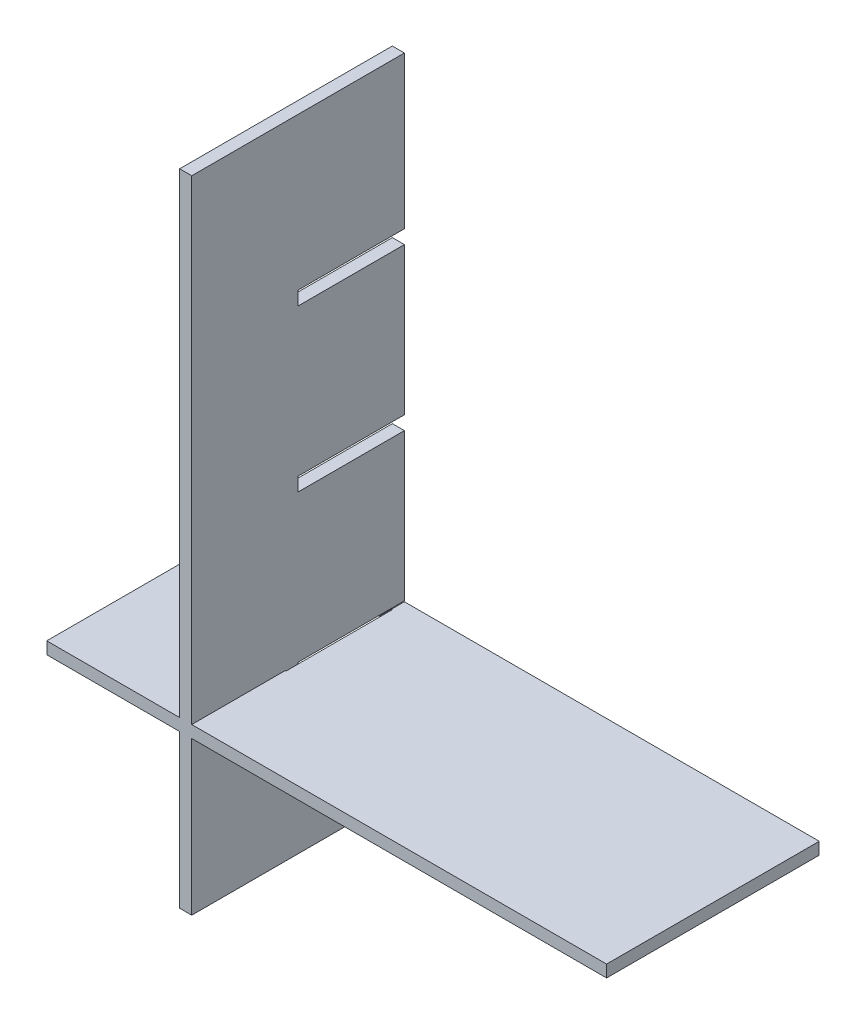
ISO-10303-21;
HEADER;
FILE_DESCRIPTION(('STEP AP214'),'2;1');
FILE_NAME('part.step','',(''),(''),'','','');
FILE_SCHEMA(('AUTOMOTIVE_DESIGN { 1 0 10303 214 1 1 1 1 }'));
ENDSEC;
DATA;
#1=APPLICATION_CONTEXT('core data for automotive mechanical design processes');
#2=APPLICATION_PROTOCOL_DEFINITION('international standard','automotive_design',2000,#1);
#3=PRODUCT_CONTEXT('',#1,'mechanical');
#4=PRODUCT('Part','Part','',(#3));
#5=PRODUCT_RELATED_PRODUCT_CATEGORY('part','',(#4));
#6=PRODUCT_DEFINITION_FORMATION('','',#4);
#7=PRODUCT_DEFINITION_CONTEXT('part definition',#1,'design');
#8=PRODUCT_DEFINITION('design','',#6,#7);
#9=PRODUCT_DEFINITION_SHAPE('','',#8);
#10=(LENGTH_UNIT() NAMED_UNIT(*) SI_UNIT(.MILLI.,.METRE.));
#11=(NAMED_UNIT(*) PLANE_ANGLE_UNIT() SI_UNIT($,.RADIAN.));
#12=(NAMED_UNIT(*) SI_UNIT($,.STERADIAN.) SOLID_ANGLE_UNIT());
#13=UNCERTAINTY_MEASURE_WITH_UNIT(LENGTH_MEASURE(1.E-05),#10,'distance_accuracy_value','');
#14=(GEOMETRIC_REPRESENTATION_CONTEXT(3) GLOBAL_UNCERTAINTY_ASSIGNED_CONTEXT((#13)) GLOBAL_UNIT_ASSIGNED_CONTEXT((#10,
#11,#12)) REPRESENTATION_CONTEXT('',''));
#15=CARTESIAN_POINT('',(0.,0.,0.));
#16=DIRECTION('',(0.,0.,1.));
#17=DIRECTION('',(1.,0.,0.));
#18=AXIS2_PLACEMENT_3D('',#15,#16,#17);
#19=CARTESIAN_POINT('',(0.,0.,0.));
#20=DIRECTION('',(0.,0.,-1.));
#21=DIRECTION('',(-1.,0.,0.));
#22=AXIS2_PLACEMENT_3D('',#19,#20,#21);
#23=PLANE('',#22);
#24=DIRECTION('',(1.,0.,0.));
#25=VECTOR('',#24,1.);
#26=CARTESIAN_POINT('',(-31.5590194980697,19.15,0.));
#27=LINE('',#26,#25);
#28=CARTESIAN_POINT('',(-18.25,19.15,0.));
#29=VERTEX_POINT('',#28);
#30=CARTESIAN_POINT('',(-16.75,19.15,0.));
#31=VERTEX_POINT('',#30);
#32=EDGE_CURVE('E270',#29,#31,#27,.T.);
#33=ORIENTED_EDGE('',*,*,#32,.T.);
#34=DIRECTION('',(0.,1.,0.));
#35=VECTOR('',#34,1.);
#36=CARTESIAN_POINT('',(-16.75,-39.75,0.));
#37=LINE('',#36,#35);
#38=CARTESIAN_POINT('',(-16.75,0.849999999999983,0.));
#39=VERTEX_POINT('',#38);
#40=EDGE_CURVE('E522',#39,#31,#37,.T.);
#41=ORIENTED_EDGE('',*,*,#40,.F.);
#42=DIRECTION('',(1.,0.,0.));
#43=VECTOR('',#42,1.);
#44=CARTESIAN_POINT('',(-31.5590194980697,0.849999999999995,0.));
#45=LINE('',#44,#43);
#46=CARTESIAN_POINT('',(-18.25,0.849999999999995,0.));
#47=VERTEX_POINT('',#46);
#48=EDGE_CURVE('E58',#47,#39,#45,.T.);
#49=ORIENTED_EDGE('',*,*,#48,.F.);
#50=DIRECTION('',(0.,-1.,0.));
#51=VECTOR('',#50,1.);
#52=CARTESIAN_POINT('',(-18.25,-39.75,0.));
#53=LINE('',#52,#51);
#54=EDGE_CURVE('E347',#29,#47,#53,.T.);
#55=ORIENTED_EDGE('',*,*,#54,.F.);
#56=EDGE_LOOP('',(#33,#41,#49,#55));
#57=FACE_BOUND('',#56,.T.);
#58=ADVANCED_FACE('F35',(#57),#23,.T.);
#59=DIRECTION('',(1.,0.,0.));
#60=VECTOR('',#59,1.);
#61=CARTESIAN_POINT('',(-31.5590194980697,-0.850000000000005,0.));
#62=LINE('',#61,#60);
#63=CARTESIAN_POINT('',(-18.25,-0.850000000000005,0.));
#64=VERTEX_POINT('',#63);
#65=CARTESIAN_POINT('',(-16.75,-0.850000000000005,0.));
#66=VERTEX_POINT('',#65);
#67=EDGE_CURVE('E282',#64,#66,#62,.T.);
#68=ORIENTED_EDGE('',*,*,#67,.T.);
#69=CARTESIAN_POINT('',(-16.75,-19.15,0.));
#70=VERTEX_POINT('',#69);
#71=EDGE_CURVE('E354',#70,#66,#37,.T.);
#72=ORIENTED_EDGE('',*,*,#71,.F.);
#73=DIRECTION('',(1.,0.,0.));
#74=VECTOR('',#73,1.);
#75=CARTESIAN_POINT('',(-31.5590194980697,-19.15,0.));
#76=LINE('',#75,#74);
#77=CARTESIAN_POINT('',(-18.25,-19.15,0.));
#78=VERTEX_POINT('',#77);
#79=EDGE_CURVE('E319',#78,#70,#76,.T.);
#80=ORIENTED_EDGE('',*,*,#79,.F.);
#81=EDGE_CURVE('E849',#64,#78,#53,.T.);
#82=ORIENTED_EDGE('',*,*,#81,.F.);
#83=EDGE_LOOP('',(#68,#72,#80,#82));
#84=FACE_BOUND('',#83,.T.);
#85=ADVANCED_FACE('F520',(#84),#23,.T.);
#86=DIRECTION('',(1.,0.,0.));
#87=VECTOR('',#86,1.);
#88=CARTESIAN_POINT('',(-31.5590194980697,-20.85,0.));
#89=LINE('',#88,#87);
#90=CARTESIAN_POINT('',(-18.25,-20.85,0.));
#91=VERTEX_POINT('',#90);
#92=CARTESIAN_POINT('',(-16.75,-20.85,0.));
#93=VERTEX_POINT('',#92);
#94=EDGE_CURVE('E303',#91,#93,#89,.T.);
#95=ORIENTED_EDGE('',*,*,#94,.T.);
#96=CARTESIAN_POINT('',(-16.75,-39.75,0.));
#97=VERTEX_POINT('',#96);
#98=EDGE_CURVE('E350',#97,#93,#37,.T.);
#99=ORIENTED_EDGE('',*,*,#98,.F.);
#100=DIRECTION('',(1.,0.,0.));
#101=VECTOR('',#100,1.);
#102=CARTESIAN_POINT('',(-18.25,-39.75,0.));
#103=LINE('',#102,#101);
#104=CARTESIAN_POINT('',(-18.25,-39.75,0.));
#105=VERTEX_POINT('',#104);
#106=EDGE_CURVE('E346',#105,#97,#103,.T.);
#107=ORIENTED_EDGE('',*,*,#106,.F.);
#108=EDGE_CURVE('E329',#91,#105,#53,.T.);
#109=ORIENTED_EDGE('',*,*,#108,.F.);
#110=EDGE_LOOP('',(#95,#99,#107,#109));
#111=FACE_BOUND('',#110,.T.);
#112=ADVANCED_FACE('F497',(#111),#23,.T.);
#113=DIRECTION('',(1.,0.,0.));
#114=VECTOR('',#113,1.);
#115=CARTESIAN_POINT('',(-31.5590194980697,20.85,0.));
#116=LINE('',#115,#114);
#117=CARTESIAN_POINT('',(-18.25,20.85,0.));
#118=VERTEX_POINT('',#117);
#119=CARTESIAN_POINT('',(-16.75,20.85,0.));
#120=VERTEX_POINT('',#119);
#121=EDGE_CURVE('E50',#118,#120,#116,.T.);
#122=ORIENTED_EDGE('',*,*,#121,.F.);
#123=CARTESIAN_POINT('',(-18.25,39.75,0.));
#124=VERTEX_POINT('',#123);
#125=EDGE_CURVE('E343',#124,#118,#53,.T.);
#126=ORIENTED_EDGE('',*,*,#125,.F.);
#127=DIRECTION('',(-1.,0.,0.));
#128=VECTOR('',#127,1.);
#129=CARTESIAN_POINT('',(-18.25,39.75,0.));
#130=LINE('',#129,#128);
#131=CARTESIAN_POINT('',(-16.75,39.75,0.));
#132=VERTEX_POINT('',#131);
#133=EDGE_CURVE('E353',#132,#124,#130,.T.);
#134=ORIENTED_EDGE('',*,*,#133,.F.);
#135=EDGE_CURVE('E349',#120,#132,#37,.T.);
#136=ORIENTED_EDGE('',*,*,#135,.F.);
#137=EDGE_LOOP('',(#122,#126,#134,#136));
#138=FACE_BOUND('',#137,.T.);
#139=ADVANCED_FACE('F532',(#138),#23,.T.);
#140=DIRECTION('',(-1.,0.,0.));
#141=VECTOR('',#140,1.);
#142=CARTESIAN_POINT('',(-34.75,-19.25,0.));
#143=LINE('',#142,#141);
#144=CARTESIAN_POINT('',(-18.25,-19.25,0.));
#145=VERTEX_POINT('',#144);
#146=CARTESIAN_POINT('',(-34.75,-19.25,0.));
#147=VERTEX_POINT('',#146);
#148=EDGE_CURVE('E423',#145,#147,#143,.T.);
#149=ORIENTED_EDGE('',*,*,#148,.F.);
#150=DIRECTION('',(0.,-1.,0.));
#151=VECTOR('',#150,1.);
#152=CARTESIAN_POINT('',(-18.25,-20.85,0.));
#153=LINE('',#152,#151);
#154=CARTESIAN_POINT('',(-18.25,-20.75,0.));
#155=VERTEX_POINT('',#154);
#156=EDGE_CURVE('E305',#145,#155,#153,.T.);
#157=ORIENTED_EDGE('',*,*,#156,.T.);
#158=DIRECTION('',(1.,0.,0.));
#159=VECTOR('',#158,1.);
#160=CARTESIAN_POINT('',(-34.75,-20.75,0.));
#161=LINE('',#160,#159);
#162=CARTESIAN_POINT('',(-34.75,-20.75,0.));
#163=VERTEX_POINT('',#162);
#164=EDGE_CURVE('E443',#163,#155,#161,.T.);
#165=ORIENTED_EDGE('',*,*,#164,.F.);
#166=DIRECTION('',(0.,-1.,0.));
#167=VECTOR('',#166,1.);
#168=CARTESIAN_POINT('',(-34.75,-19.25,0.));
#169=LINE('',#168,#167);
#170=EDGE_CURVE('E440',#147,#163,#169,.T.);
#171=ORIENTED_EDGE('',*,*,#170,.F.);
#172=EDGE_LOOP('',(#149,#157,#165,#171));
#173=FACE_BOUND('',#172,.T.);
#174=ADVANCED_FACE('F565',(#173),#23,.T.);
#175=CARTESIAN_POINT('',(-34.75,-19.25,26.4));
#176=DIRECTION('',(0.,-1.,0.));
#177=DIRECTION('',(0.,0.,-1.));
#178=AXIS2_PLACEMENT_3D('',#175,#176,#177);
#179=PLANE('',#178);
#180=DIRECTION('',(0.,0.,1.));
#181=VECTOR('',#180,1.);
#182=CARTESIAN_POINT('',(-18.25,-19.25,26.4));
#183=LINE('',#182,#181);
#184=CARTESIAN_POINT('',(-18.25,-19.25,1.6));
#185=VERTEX_POINT('',#184);
#186=EDGE_CURVE('E385',#145,#185,#183,.T.);
#187=ORIENTED_EDGE('',*,*,#186,.F.);
#188=ORIENTED_EDGE('',*,*,#148,.T.);
#189=DIRECTION('',(0.,0.,-1.));
#190=VECTOR('',#189,1.);
#191=CARTESIAN_POINT('',(-34.75,-19.25,26.4));
#192=LINE('',#191,#190);
#193=CARTESIAN_POINT('',(-34.75,-19.25,26.4));
#194=VERTEX_POINT('',#193);
#195=EDGE_CURVE('E456',#194,#147,#192,.T.);
#196=ORIENTED_EDGE('',*,*,#195,.F.);
#197=DIRECTION('',(-1.,0.,0.));
#198=VECTOR('',#197,1.);
#199=CARTESIAN_POINT('',(-34.75,-19.25,26.4));
#200=LINE('',#199,#198);
#201=CARTESIAN_POINT('',(-18.25,-19.25,26.4));
#202=VERTEX_POINT('',#201);
#203=EDGE_CURVE('E428',#202,#194,#200,.T.);
#204=ORIENTED_EDGE('',*,*,#203,.F.);
#205=CARTESIAN_POINT('',(-18.25,-19.25,14.8));
#206=VERTEX_POINT('',#205);
#207=EDGE_CURVE('E380',#206,#202,#183,.T.);
#208=ORIENTED_EDGE('',*,*,#207,.F.);
#209=DIRECTION('',(1.,0.,0.));
#210=VECTOR('',#209,1.);
#211=CARTESIAN_POINT('',(-18.35,-19.25,14.8));
#212=LINE('',#211,#210);
#213=CARTESIAN_POINT('',(-18.35,-19.25,14.8));
#214=VERTEX_POINT('',#213);
#215=EDGE_CURVE('E420',#214,#206,#212,.T.);
#216=ORIENTED_EDGE('',*,*,#215,.F.);
#217=DIRECTION('',(0.,0.,1.));
#218=VECTOR('',#217,1.);
#219=CARTESIAN_POINT('',(-18.35,-19.25,1.6));
#220=LINE('',#219,#218);
#221=CARTESIAN_POINT('',(-18.35,-19.25,1.6));
#222=VERTEX_POINT('',#221);
#223=EDGE_CURVE('E387',#222,#214,#220,.T.);
#224=ORIENTED_EDGE('',*,*,#223,.F.);
#225=DIRECTION('',(-1.,0.,0.));
#226=VECTOR('',#225,1.);
#227=CARTESIAN_POINT('',(-18.35,-19.25,1.6));
#228=LINE('',#227,#226);
#229=EDGE_CURVE('E390',#185,#222,#228,.T.);
#230=ORIENTED_EDGE('',*,*,#229,.F.);
#231=EDGE_LOOP('',(#187,#188,#196,#204,#208,#216,#224,#230));
#232=FACE_BOUND('',#231,.T.);
#233=ADVANCED_FACE('F37',(#232),#179,.F.);
#234=DIRECTION('',(0.,0.,-1.));
#235=VECTOR('',#234,1.);
#236=CARTESIAN_POINT('',(-16.75,-19.25,26.4));
#237=LINE('',#236,#235);
#238=CARTESIAN_POINT('',(-16.75,-19.25,26.4));
#239=VERTEX_POINT('',#238);
#240=CARTESIAN_POINT('',(-16.75,-19.25,14.8));
#241=VERTEX_POINT('',#240);
#242=EDGE_CURVE('E370',#239,#241,#237,.T.);
#243=ORIENTED_EDGE('',*,*,#242,.F.);
#244=CARTESIAN_POINT('',(34.75,-19.25,26.4));
#245=VERTEX_POINT('',#244);
#246=EDGE_CURVE('E424',#245,#239,#200,.T.);
#247=ORIENTED_EDGE('',*,*,#246,.F.);
#248=DIRECTION('',(0.,0.,-1.));
#249=VECTOR('',#248,1.);
#250=CARTESIAN_POINT('',(34.75,-19.25,26.4));
#251=LINE('',#250,#249);
#252=CARTESIAN_POINT('',(34.75,-19.25,0.));
#253=VERTEX_POINT('',#252);
#254=EDGE_CURVE('E436',#245,#253,#251,.T.);
#255=ORIENTED_EDGE('',*,*,#254,.T.);
#256=CARTESIAN_POINT('',(-16.75,-19.25,0.));
#257=VERTEX_POINT('',#256);
#258=EDGE_CURVE('E437',#253,#257,#143,.T.);
#259=ORIENTED_EDGE('',*,*,#258,.T.);
#260=CARTESIAN_POINT('',(-16.75,-19.25,1.6));
#261=VERTEX_POINT('',#260);
#262=EDGE_CURVE('E375',#261,#257,#237,.T.);
#263=ORIENTED_EDGE('',*,*,#262,.F.);
#264=CARTESIAN_POINT('',(-16.65,-19.25,1.6));
#265=VERTEX_POINT('',#264);
#266=EDGE_CURVE('E392',#265,#261,#228,.T.);
#267=ORIENTED_EDGE('',*,*,#266,.F.);
#268=DIRECTION('',(0.,0.,-1.));
#269=VECTOR('',#268,1.);
#270=CARTESIAN_POINT('',(-16.65,-19.25,1.6));
#271=LINE('',#270,#269);
#272=CARTESIAN_POINT('',(-16.65,-19.25,14.8));
#273=VERTEX_POINT('',#272);
#274=EDGE_CURVE('E395',#273,#265,#271,.T.);
#275=ORIENTED_EDGE('',*,*,#274,.F.);
#276=EDGE_CURVE('E397',#241,#273,#212,.T.);
#277=ORIENTED_EDGE('',*,*,#276,.F.);
#278=EDGE_LOOP('',(#243,#247,#255,#259,#263,#267,#275,#277));
#279=FACE_BOUND('',#278,.T.);
#280=ADVANCED_FACE('F469',(#279),#179,.F.);
#281=CARTESIAN_POINT('',(-34.75,-20.75,26.4));
#282=DIRECTION('',(0.,1.,0.));
#283=DIRECTION('',(0.,0.,1.));
#284=AXIS2_PLACEMENT_3D('',#281,#282,#283);
#285=PLANE('',#284);
#286=DIRECTION('',(0.,0.,-1.));
#287=VECTOR('',#286,1.);
#288=CARTESIAN_POINT('',(-18.25,-20.75,26.4));
#289=LINE('',#288,#287);
#290=CARTESIAN_POINT('',(-18.25,-20.75,26.4));
#291=VERTEX_POINT('',#290);
#292=CARTESIAN_POINT('',(-18.25,-20.75,14.8));
#293=VERTEX_POINT('',#292);
#294=EDGE_CURVE('E377',#291,#293,#289,.T.);
#295=ORIENTED_EDGE('',*,*,#294,.F.);
#296=DIRECTION('',(1.,0.,0.));
#297=VECTOR('',#296,1.);
#298=CARTESIAN_POINT('',(-34.75,-20.75,26.4));
#299=LINE('',#298,#297);
#300=CARTESIAN_POINT('',(-34.75,-20.75,26.4));
#301=VERTEX_POINT('',#300);
#302=EDGE_CURVE('E431',#301,#291,#299,.T.);
#303=ORIENTED_EDGE('',*,*,#302,.F.);
#304=DIRECTION('',(0.,0.,-1.));
#305=VECTOR('',#304,1.);
#306=CARTESIAN_POINT('',(-34.75,-20.75,26.4));
#307=LINE('',#306,#305);
#308=EDGE_CURVE('E453',#301,#163,#307,.T.);
#309=ORIENTED_EDGE('',*,*,#308,.T.);
#310=ORIENTED_EDGE('',*,*,#164,.T.);
#311=CARTESIAN_POINT('',(-18.25,-20.75,1.6));
#312=VERTEX_POINT('',#311);
#313=EDGE_CURVE('E381',#312,#155,#289,.T.);
#314=ORIENTED_EDGE('',*,*,#313,.F.);
#315=DIRECTION('',(1.,0.,0.));
#316=VECTOR('',#315,1.);
#317=CARTESIAN_POINT('',(-18.35,-20.75,1.6));
#318=LINE('',#317,#316);
#319=CARTESIAN_POINT('',(-18.35,-20.75,1.6));
#320=VERTEX_POINT('',#319);
#321=EDGE_CURVE('E407',#320,#312,#318,.T.);
#322=ORIENTED_EDGE('',*,*,#321,.F.);
#323=DIRECTION('',(0.,0.,-1.));
#324=VECTOR('',#323,1.);
#325=CARTESIAN_POINT('',(-18.35,-20.75,1.6));
#326=LINE('',#325,#324);
#327=CARTESIAN_POINT('',(-18.35,-20.75,14.8));
#328=VERTEX_POINT('',#327);
#329=EDGE_CURVE('E403',#328,#320,#326,.T.);
#330=ORIENTED_EDGE('',*,*,#329,.F.);
#331=DIRECTION('',(-1.,0.,0.));
#332=VECTOR('',#331,1.);
#333=CARTESIAN_POINT('',(-18.35,-20.75,14.8));
#334=LINE('',#333,#332);
#335=EDGE_CURVE('E400',#293,#328,#334,.T.);
#336=ORIENTED_EDGE('',*,*,#335,.F.);
#337=EDGE_LOOP('',(#295,#303,#309,#310,#314,#322,#330,#336));
#338=FACE_BOUND('',#337,.T.);
#339=ADVANCED_FACE('F591',(#338),#285,.F.);
#340=DIRECTION('',(0.,0.,1.));
#341=VECTOR('',#340,1.);
#342=CARTESIAN_POINT('',(-16.75,-20.75,26.4));
#343=LINE('',#342,#341);
#344=CARTESIAN_POINT('',(-16.75,-20.75,0.));
#345=VERTEX_POINT('',#344);
#346=CARTESIAN_POINT('',(-16.75,-20.75,1.6));
#347=VERTEX_POINT('',#346);
#348=EDGE_CURVE('E371',#345,#347,#343,.T.);
#349=ORIENTED_EDGE('',*,*,#348,.F.);
#350=CARTESIAN_POINT('',(34.75,-20.75,0.));
#351=VERTEX_POINT('',#350);
#352=EDGE_CURVE('E442',#345,#351,#161,.T.);
#353=ORIENTED_EDGE('',*,*,#352,.T.);
#354=DIRECTION('',(0.,0.,-1.));
#355=VECTOR('',#354,1.);
#356=CARTESIAN_POINT('',(34.75,-20.75,26.4));
#357=LINE('',#356,#355);
#358=CARTESIAN_POINT('',(34.75,-20.75,26.4));
#359=VERTEX_POINT('',#358);
#360=EDGE_CURVE('E450',#359,#351,#357,.T.);
#361=ORIENTED_EDGE('',*,*,#360,.F.);
#362=CARTESIAN_POINT('',(-16.75,-20.75,26.4));
#363=VERTEX_POINT('',#362);
#364=EDGE_CURVE('E430',#363,#359,#299,.T.);
#365=ORIENTED_EDGE('',*,*,#364,.F.);
#366=CARTESIAN_POINT('',(-16.75,-20.75,14.8));
#367=VERTEX_POINT('',#366);
#368=EDGE_CURVE('E367',#367,#363,#343,.T.);
#369=ORIENTED_EDGE('',*,*,#368,.F.);
#370=CARTESIAN_POINT('',(-16.65,-20.75,14.8));
#371=VERTEX_POINT('',#370);
#372=EDGE_CURVE('E401',#371,#367,#334,.T.);
#373=ORIENTED_EDGE('',*,*,#372,.F.);
#374=DIRECTION('',(0.,0.,1.));
#375=VECTOR('',#374,1.);
#376=CARTESIAN_POINT('',(-16.65,-20.75,1.6));
#377=LINE('',#376,#375);
#378=CARTESIAN_POINT('',(-16.65,-20.75,1.6));
#379=VERTEX_POINT('',#378);
#380=EDGE_CURVE('E398',#379,#371,#377,.T.);
#381=ORIENTED_EDGE('',*,*,#380,.F.);
#382=EDGE_CURVE('E406',#347,#379,#318,.T.);
#383=ORIENTED_EDGE('',*,*,#382,.F.);
#384=EDGE_LOOP('',(#349,#353,#361,#365,#369,#373,#381,#383));
#385=FACE_BOUND('',#384,.T.);
#386=ADVANCED_FACE('F483',(#385),#285,.F.);
#387=CARTESIAN_POINT('',(-18.35,-5.9409805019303,1.6));
#388=DIRECTION('',(0.,0.,-1.));
#389=DIRECTION('',(-1.,0.,0.));
#390=AXIS2_PLACEMENT_3D('',#387,#388,#389);
#391=PLANE('',#390);
#392=DIRECTION('',(0.,-1.,0.));
#393=VECTOR('',#392,1.);
#394=CARTESIAN_POINT('',(-18.25,-5.9409805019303,1.6));
#395=LINE('',#394,#393);
#396=EDGE_CURVE('E384',#185,#312,#395,.T.);
#397=ORIENTED_EDGE('',*,*,#396,.F.);
#398=ORIENTED_EDGE('',*,*,#229,.T.);
#399=DIRECTION('',(0.,-1.,0.));
#400=VECTOR('',#399,1.);
#401=CARTESIAN_POINT('',(-18.35,-5.9409805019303,1.6));
#402=LINE('',#401,#400);
#403=EDGE_CURVE('E413',#222,#320,#402,.T.);
#404=ORIENTED_EDGE('',*,*,#403,.T.);
#405=ORIENTED_EDGE('',*,*,#321,.T.);
#406=EDGE_LOOP('',(#397,#398,#404,#405));
#407=FACE_BOUND('',#406,.T.);
#408=ADVANCED_FACE('F594',(#407),#391,.F.);
#409=DIRECTION('',(0.,1.,0.));
#410=VECTOR('',#409,1.);
#411=CARTESIAN_POINT('',(-16.75,-5.9409805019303,1.6));
#412=LINE('',#411,#410);
#413=EDGE_CURVE('E374',#347,#261,#412,.T.);
#414=ORIENTED_EDGE('',*,*,#413,.F.);
#415=ORIENTED_EDGE('',*,*,#382,.T.);
#416=DIRECTION('',(0.,-1.,0.));
#417=VECTOR('',#416,1.);
#418=CARTESIAN_POINT('',(-16.65,-5.9409805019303,1.6));
#419=LINE('',#418,#417);
#420=EDGE_CURVE('E391',#265,#379,#419,.T.);
#421=ORIENTED_EDGE('',*,*,#420,.F.);
#422=ORIENTED_EDGE('',*,*,#266,.T.);
#423=EDGE_LOOP('',(#414,#415,#421,#422));
#424=FACE_BOUND('',#423,.T.);
#425=ADVANCED_FACE('F479',(#424),#391,.F.);
#426=CARTESIAN_POINT('',(-18.35,-5.9409805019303,14.8));
#427=DIRECTION('',(0.,0.,1.));
#428=DIRECTION('',(1.,0.,0.));
#429=AXIS2_PLACEMENT_3D('',#426,#427,#428);
#430=PLANE('',#429);
#431=DIRECTION('',(0.,1.,0.));
#432=VECTOR('',#431,1.);
#433=CARTESIAN_POINT('',(-18.25,-5.9409805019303,14.8));
#434=LINE('',#433,#432);
#435=EDGE_CURVE('E11',#293,#206,#434,.T.);
#436=ORIENTED_EDGE('',*,*,#435,.F.);
#437=ORIENTED_EDGE('',*,*,#335,.T.);
#438=DIRECTION('',(0.,-1.,0.));
#439=VECTOR('',#438,1.);
#440=CARTESIAN_POINT('',(-18.35,-5.9409805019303,14.8));
#441=LINE('',#440,#439);
#442=EDGE_CURVE('E415',#214,#328,#441,.T.);
#443=ORIENTED_EDGE('',*,*,#442,.F.);
#444=ORIENTED_EDGE('',*,*,#215,.T.);
#445=EDGE_LOOP('',(#436,#437,#443,#444));
#446=FACE_BOUND('',#445,.T.);
#447=ADVANCED_FACE('F617',(#446),#430,.F.);
#448=DIRECTION('',(0.,-1.,0.));
#449=VECTOR('',#448,1.);
#450=CARTESIAN_POINT('',(-16.75,-5.9409805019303,14.8));
#451=LINE('',#450,#449);
#452=EDGE_CURVE('E43',#241,#367,#451,.T.);
#453=ORIENTED_EDGE('',*,*,#452,.F.);
#454=ORIENTED_EDGE('',*,*,#276,.T.);
#455=DIRECTION('',(0.,-1.,0.));
#456=VECTOR('',#455,1.);
#457=CARTESIAN_POINT('',(-16.65,-5.9409805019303,14.8));
#458=LINE('',#457,#456);
#459=EDGE_CURVE('E410',#273,#371,#458,.T.);
#460=ORIENTED_EDGE('',*,*,#459,.T.);
#461=ORIENTED_EDGE('',*,*,#372,.T.);
#462=EDGE_LOOP('',(#453,#454,#460,#461));
#463=FACE_BOUND('',#462,.T.);
#464=ADVANCED_FACE('F464',(#463),#430,.F.);
#465=CARTESIAN_POINT('',(-34.75,-19.25,26.4));
#466=DIRECTION('',(1.,0.,0.));
#467=DIRECTION('',(0.,0.,-1.));
#468=AXIS2_PLACEMENT_3D('',#465,#466,#467);
#469=PLANE('',#468);
#470=ORIENTED_EDGE('',*,*,#170,.T.);
#471=ORIENTED_EDGE('',*,*,#308,.F.);
#472=DIRECTION('',(0.,-1.,0.));
#473=VECTOR('',#472,1.);
#474=CARTESIAN_POINT('',(-34.75,-19.25,26.4));
#475=LINE('',#474,#473);
#476=EDGE_CURVE('E427',#194,#301,#475,.T.);
#477=ORIENTED_EDGE('',*,*,#476,.F.);
#478=ORIENTED_EDGE('',*,*,#195,.T.);
#479=EDGE_LOOP('',(#470,#471,#477,#478));
#480=FACE_BOUND('',#479,.T.);
#481=ADVANCED_FACE('F623',(#480),#469,.F.);
#482=CARTESIAN_POINT('',(34.75,-19.25,26.4));
#483=DIRECTION('',(-1.,0.,0.));
#484=DIRECTION('',(0.,-1.,0.));
#485=AXIS2_PLACEMENT_3D('',#482,#483,#484);
#486=PLANE('',#485);
#487=DIRECTION('',(0.,1.,0.));
#488=VECTOR('',#487,1.);
#489=CARTESIAN_POINT('',(34.75,-19.25,0.));
#490=LINE('',#489,#488);
#491=EDGE_CURVE('E446',#351,#253,#490,.T.);
#492=ORIENTED_EDGE('',*,*,#491,.T.);
#493=ORIENTED_EDGE('',*,*,#254,.F.);
#494=DIRECTION('',(0.,1.,0.));
#495=VECTOR('',#494,1.);
#496=CARTESIAN_POINT('',(34.75,-19.25,26.4));
#497=LINE('',#496,#495);
#498=EDGE_CURVE('E434',#359,#245,#497,.T.);
#499=ORIENTED_EDGE('',*,*,#498,.F.);
#500=ORIENTED_EDGE('',*,*,#360,.T.);
#501=EDGE_LOOP('',(#492,#493,#499,#500));
#502=FACE_BOUND('',#501,.T.);
#503=ADVANCED_FACE('F572',(#502),#486,.F.);
#504=CARTESIAN_POINT('',(0.,0.,26.4));
#505=DIRECTION('',(0.,0.,-1.));
#506=DIRECTION('',(-1.,0.,0.));
#507=AXIS2_PLACEMENT_3D('',#504,#505,#506);
#508=PLANE('',#507);
#509=ORIENTED_EDGE('',*,*,#246,.T.);
#510=DIRECTION('',(0.,1.,0.));
#511=VECTOR('',#510,1.);
#512=CARTESIAN_POINT('',(-16.75,-39.75,26.4));
#513=LINE('',#512,#511);
#514=CARTESIAN_POINT('',(-16.75,39.75,26.4));
#515=VERTEX_POINT('',#514);
#516=EDGE_CURVE('E336',#239,#515,#513,.T.);
#517=ORIENTED_EDGE('',*,*,#516,.T.);
#518=DIRECTION('',(-1.,0.,0.));
#519=VECTOR('',#518,1.);
#520=CARTESIAN_POINT('',(-18.25,39.75,26.4));
#521=LINE('',#520,#519);
#522=CARTESIAN_POINT('',(-18.25,39.75,26.4));
#523=VERTEX_POINT('',#522);
#524=EDGE_CURVE('E340',#515,#523,#521,.T.);
#525=ORIENTED_EDGE('',*,*,#524,.T.);
#526=DIRECTION('',(0.,-1.,0.));
#527=VECTOR('',#526,1.);
#528=CARTESIAN_POINT('',(-18.25,-39.75,26.4));
#529=LINE('',#528,#527);
#530=EDGE_CURVE('E330',#523,#202,#529,.T.);
#531=ORIENTED_EDGE('',*,*,#530,.T.);
#532=ORIENTED_EDGE('',*,*,#203,.T.);
#533=ORIENTED_EDGE('',*,*,#476,.T.);
#534=ORIENTED_EDGE('',*,*,#302,.T.);
#535=CARTESIAN_POINT('',(-18.25,-39.75,26.4));
#536=VERTEX_POINT('',#535);
#537=EDGE_CURVE('E334',#291,#536,#529,.T.);
#538=ORIENTED_EDGE('',*,*,#537,.T.);
#539=DIRECTION('',(1.,0.,0.));
#540=VECTOR('',#539,1.);
#541=CARTESIAN_POINT('',(-18.25,-39.75,26.4));
#542=LINE('',#541,#540);
#543=CARTESIAN_POINT('',(-16.75,-39.75,26.4));
#544=VERTEX_POINT('',#543);
#545=EDGE_CURVE('E333',#536,#544,#542,.T.);
#546=ORIENTED_EDGE('',*,*,#545,.T.);
#547=EDGE_CURVE('E337',#544,#363,#513,.T.);
#548=ORIENTED_EDGE('',*,*,#547,.T.);
#549=ORIENTED_EDGE('',*,*,#364,.T.);
#550=ORIENTED_EDGE('',*,*,#498,.T.);
#551=EDGE_LOOP('',(#509,#517,#525,#531,#532,#533,#534,#538,#546,#548,#549,#550));
#552=FACE_BOUND('',#551,.T.);
#553=ADVANCED_FACE('F488',(#552),#508,.F.);
#554=DIRECTION('',(0.,1.,0.));
#555=VECTOR('',#554,1.);
#556=CARTESIAN_POINT('',(-16.75,-20.85,0.));
#557=LINE('',#556,#555);
#558=EDGE_CURVE('E299',#345,#257,#557,.T.);
#559=ORIENTED_EDGE('',*,*,#558,.T.);
#560=ORIENTED_EDGE('',*,*,#258,.F.);
#561=ORIENTED_EDGE('',*,*,#491,.F.);
#562=ORIENTED_EDGE('',*,*,#352,.F.);
#563=EDGE_LOOP('',(#559,#560,#561,#562));
#564=FACE_BOUND('',#563,.T.);
#565=ADVANCED_FACE('F539',(#564),#23,.T.);
#566=CARTESIAN_POINT('',(-16.65,-5.9409805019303,1.6));
#567=DIRECTION('',(1.,0.,0.));
#568=DIRECTION('',(0.,0.,-1.));
#569=AXIS2_PLACEMENT_3D('',#566,#567,#568);
#570=PLANE('',#569);
#571=ORIENTED_EDGE('',*,*,#274,.T.);
#572=ORIENTED_EDGE('',*,*,#420,.T.);
#573=ORIENTED_EDGE('',*,*,#380,.T.);
#574=ORIENTED_EDGE('',*,*,#459,.F.);
#575=EDGE_LOOP('',(#571,#572,#573,#574));
#576=FACE_BOUND('',#575,.T.);
#577=ADVANCED_FACE('F475',(#576),#570,.F.);
#578=CARTESIAN_POINT('',(-18.35,-5.9409805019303,1.6));
#579=DIRECTION('',(-1.,0.,0.));
#580=DIRECTION('',(0.,0.,1.));
#581=AXIS2_PLACEMENT_3D('',#578,#579,#580);
#582=PLANE('',#581);
#583=ORIENTED_EDGE('',*,*,#223,.T.);
#584=ORIENTED_EDGE('',*,*,#442,.T.);
#585=ORIENTED_EDGE('',*,*,#329,.T.);
#586=ORIENTED_EDGE('',*,*,#403,.F.);
#587=EDGE_LOOP('',(#583,#584,#585,#586));
#588=FACE_BOUND('',#587,.T.);
#589=ADVANCED_FACE('F570',(#588),#582,.F.);
#590=CARTESIAN_POINT('',(-18.25,-39.75,26.4));
#591=DIRECTION('',(1.,0.,0.));
#592=DIRECTION('',(0.,0.,-1.));
#593=AXIS2_PLACEMENT_3D('',#590,#591,#592);
#594=PLANE('',#593);
#595=DIRECTION('',(0.,1.,0.));
#596=VECTOR('',#595,1.);
#597=CARTESIAN_POINT('',(-18.25,19.15,13.2));
#598=LINE('',#597,#596);
#599=CARTESIAN_POINT('',(-18.25,19.15,13.2));
#600=VERTEX_POINT('',#599);
#601=CARTESIAN_POINT('',(-18.25,20.85,13.2));
#602=VERTEX_POINT('',#601);
#603=EDGE_CURVE('E254',#600,#602,#598,.T.);
#604=ORIENTED_EDGE('',*,*,#603,.F.);
#605=DIRECTION('',(0.,0.,1.));
#606=VECTOR('',#605,1.);
#607=CARTESIAN_POINT('',(-18.25,19.15,0.));
#608=LINE('',#607,#606);
#609=EDGE_CURVE('E278',#29,#600,#608,.T.);
#610=ORIENTED_EDGE('',*,*,#609,.F.);
#611=ORIENTED_EDGE('',*,*,#54,.T.);
#612=DIRECTION('',(0.,0.,-1.));
#613=VECTOR('',#612,1.);
#614=CARTESIAN_POINT('',(-18.25,0.849999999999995,0.));
#615=LINE('',#614,#613);
#616=CARTESIAN_POINT('',(-18.25,0.849999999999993,13.2));
#617=VERTEX_POINT('',#616);
#618=EDGE_CURVE('E284',#617,#47,#615,.T.);
#619=ORIENTED_EDGE('',*,*,#618,.F.);
#620=DIRECTION('',(0.,1.,0.));
#621=VECTOR('',#620,1.);
#622=CARTESIAN_POINT('',(-18.25,-0.850000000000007,13.2));
#623=LINE('',#622,#621);
#624=CARTESIAN_POINT('',(-18.25,-0.850000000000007,13.2));
#625=VERTEX_POINT('',#624);
#626=EDGE_CURVE('E279',#625,#617,#623,.T.);
#627=ORIENTED_EDGE('',*,*,#626,.F.);
#628=DIRECTION('',(0.,0.,1.));
#629=VECTOR('',#628,1.);
#630=CARTESIAN_POINT('',(-18.25,-0.850000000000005,0.));
#631=LINE('',#630,#629);
#632=EDGE_CURVE('E281',#64,#625,#631,.T.);
#633=ORIENTED_EDGE('',*,*,#632,.F.);
#634=ORIENTED_EDGE('',*,*,#81,.T.);
#635=DIRECTION('',(0.,0.,-1.));
#636=VECTOR('',#635,1.);
#637=CARTESIAN_POINT('',(-18.25,-19.15,0.));
#638=LINE('',#637,#636);
#639=CARTESIAN_POINT('',(-18.25,-19.15,13.2));
#640=VERTEX_POINT('',#639);
#641=EDGE_CURVE('E308',#640,#78,#638,.T.);
#642=ORIENTED_EDGE('',*,*,#641,.F.);
#643=DIRECTION('',(0.,1.,0.));
#644=VECTOR('',#643,1.);
#645=CARTESIAN_POINT('',(-18.25,-20.85,13.2));
#646=LINE('',#645,#644);
#647=CARTESIAN_POINT('',(-18.25,-20.85,13.2));
#648=VERTEX_POINT('',#647);
#649=EDGE_CURVE('E300',#648,#640,#646,.T.);
#650=ORIENTED_EDGE('',*,*,#649,.F.);
#651=DIRECTION('',(0.,0.,1.));
#652=VECTOR('',#651,1.);
#653=CARTESIAN_POINT('',(-18.25,-20.85,0.));
#654=LINE('',#653,#652);
#655=EDGE_CURVE('E302',#91,#648,#654,.T.);
#656=ORIENTED_EDGE('',*,*,#655,.F.);
#657=ORIENTED_EDGE('',*,*,#108,.T.);
#658=DIRECTION('',(0.,0.,-1.));
#659=VECTOR('',#658,1.);
#660=CARTESIAN_POINT('',(-18.25,-39.75,26.4));
#661=LINE('',#660,#659);
#662=EDGE_CURVE('E364',#536,#105,#661,.T.);
#663=ORIENTED_EDGE('',*,*,#662,.F.);
#664=ORIENTED_EDGE('',*,*,#537,.F.);
#665=ORIENTED_EDGE('',*,*,#294,.T.);
#666=ORIENTED_EDGE('',*,*,#435,.T.);
#667=ORIENTED_EDGE('',*,*,#207,.T.);
#668=ORIENTED_EDGE('',*,*,#530,.F.);
#669=DIRECTION('',(0.,0.,-1.));
#670=VECTOR('',#669,1.);
#671=CARTESIAN_POINT('',(-18.25,39.75,26.4));
#672=LINE('',#671,#670);
#673=EDGE_CURVE('E342',#523,#124,#672,.T.);
#674=ORIENTED_EDGE('',*,*,#673,.T.);
#675=ORIENTED_EDGE('',*,*,#125,.T.);
#676=DIRECTION('',(0.,0.,-1.));
#677=VECTOR('',#676,1.);
#678=CARTESIAN_POINT('',(-18.25,20.85,0.));
#679=LINE('',#678,#677);
#680=EDGE_CURVE('E275',#602,#118,#679,.T.);
#681=ORIENTED_EDGE('',*,*,#680,.F.);
#682=EDGE_LOOP('',(#604,#610,#611,#619,#627,#633,#634,#642,#650,#656,#657,#663,#664,#665,#666,
#667,#668,#674,#675,#681));
#683=FACE_BOUND('',#682,.T.);
#684=ADVANCED_FACE('F505',(#683),#594,.F.);
#685=CARTESIAN_POINT('',(-16.75,-39.75,26.4));
#686=DIRECTION('',(-1.,0.,0.));
#687=DIRECTION('',(0.,0.,1.));
#688=AXIS2_PLACEMENT_3D('',#685,#686,#687);
#689=PLANE('',#688);
#690=ORIENTED_EDGE('',*,*,#40,.T.);
#691=DIRECTION('',(0.,0.,-1.));
#692=VECTOR('',#691,1.);
#693=CARTESIAN_POINT('',(-16.75,19.15,0.));
#694=LINE('',#693,#692);
#695=CARTESIAN_POINT('',(-16.75,19.15,13.2));
#696=VERTEX_POINT('',#695);
#697=EDGE_CURVE('E265',#696,#31,#694,.T.);
#698=ORIENTED_EDGE('',*,*,#697,.F.);
#699=DIRECTION('',(0.,-1.,0.));
#700=VECTOR('',#699,1.);
#701=CARTESIAN_POINT('',(-16.75,19.15,13.2));
#702=LINE('',#701,#700);
#703=CARTESIAN_POINT('',(-16.75,20.85,13.2));
#704=VERTEX_POINT('',#703);
#705=EDGE_CURVE('E251',#704,#696,#702,.T.);
#706=ORIENTED_EDGE('',*,*,#705,.F.);
#707=DIRECTION('',(0.,0.,1.));
#708=VECTOR('',#707,1.);
#709=CARTESIAN_POINT('',(-16.75,20.85,0.));
#710=LINE('',#709,#708);
#711=EDGE_CURVE('E258',#120,#704,#710,.T.);
#712=ORIENTED_EDGE('',*,*,#711,.F.);
#713=ORIENTED_EDGE('',*,*,#135,.T.);
#714=DIRECTION('',(0.,0.,-1.));
#715=VECTOR('',#714,1.);
#716=CARTESIAN_POINT('',(-16.75,39.75,26.4));
#717=LINE('',#716,#715);
#718=EDGE_CURVE('E358',#515,#132,#717,.T.);
#719=ORIENTED_EDGE('',*,*,#718,.F.);
#720=ORIENTED_EDGE('',*,*,#516,.F.);
#721=ORIENTED_EDGE('',*,*,#242,.T.);
#722=ORIENTED_EDGE('',*,*,#452,.T.);
#723=ORIENTED_EDGE('',*,*,#368,.T.);
#724=ORIENTED_EDGE('',*,*,#547,.F.);
#725=DIRECTION('',(0.,0.,-1.));
#726=VECTOR('',#725,1.);
#727=CARTESIAN_POINT('',(-16.75,-39.75,26.4));
#728=LINE('',#727,#726);
#729=EDGE_CURVE('E361',#544,#97,#728,.T.);
#730=ORIENTED_EDGE('',*,*,#729,.T.);
#731=ORIENTED_EDGE('',*,*,#98,.T.);
#732=DIRECTION('',(0.,0.,-1.));
#733=VECTOR('',#732,1.);
#734=CARTESIAN_POINT('',(-16.75,-20.85,0.));
#735=LINE('',#734,#733);
#736=CARTESIAN_POINT('',(-16.75,-20.85,13.2));
#737=VERTEX_POINT('',#736);
#738=EDGE_CURVE('E317',#737,#93,#735,.T.);
#739=ORIENTED_EDGE('',*,*,#738,.F.);
#740=DIRECTION('',(0.,-1.,0.));
#741=VECTOR('',#740,1.);
#742=CARTESIAN_POINT('',(-16.75,-20.85,13.2));
#743=LINE('',#742,#741);
#744=CARTESIAN_POINT('',(-16.75,-19.15,13.2));
#745=VERTEX_POINT('',#744);
#746=EDGE_CURVE('E314',#745,#737,#743,.T.);
#747=ORIENTED_EDGE('',*,*,#746,.F.);
#748=DIRECTION('',(0.,0.,1.));
#749=VECTOR('',#748,1.);
#750=CARTESIAN_POINT('',(-16.75,-19.15,0.));
#751=LINE('',#750,#749);
#752=EDGE_CURVE('E311',#70,#745,#751,.T.);
#753=ORIENTED_EDGE('',*,*,#752,.F.);
#754=ORIENTED_EDGE('',*,*,#71,.T.);
#755=DIRECTION('',(0.,0.,-1.));
#756=VECTOR('',#755,1.);
#757=CARTESIAN_POINT('',(-16.75,-0.850000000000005,0.));
#758=LINE('',#757,#756);
#759=CARTESIAN_POINT('',(-16.75,-0.850000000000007,13.2));
#760=VERTEX_POINT('',#759);
#761=EDGE_CURVE('E289',#760,#66,#758,.T.);
#762=ORIENTED_EDGE('',*,*,#761,.F.);
#763=DIRECTION('',(0.,-1.,0.));
#764=VECTOR('',#763,1.);
#765=CARTESIAN_POINT('',(-16.75,-0.850000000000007,13.2));
#766=LINE('',#765,#764);
#767=CARTESIAN_POINT('',(-16.75,0.849999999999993,13.2));
#768=VERTEX_POINT('',#767);
#769=EDGE_CURVE('E286',#768,#760,#766,.T.);
#770=ORIENTED_EDGE('',*,*,#769,.F.);
#771=DIRECTION('',(0.,0.,1.));
#772=VECTOR('',#771,1.);
#773=CARTESIAN_POINT('',(-16.75,0.849999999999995,0.));
#774=LINE('',#773,#772);
#775=EDGE_CURVE('E277',#39,#768,#774,.T.);
#776=ORIENTED_EDGE('',*,*,#775,.F.);
#777=EDGE_LOOP('',(#690,#698,#706,#712,#713,#719,#720,#721,#722,#723,#724,#730,#731,#739,#747,
#753,#754,#762,#770,#776));
#778=FACE_BOUND('',#777,.T.);
#779=ADVANCED_FACE('F264',(#778),#689,.F.);
#780=CARTESIAN_POINT('',(-18.25,-39.75,26.4));
#781=DIRECTION('',(0.,1.,0.));
#782=DIRECTION('',(0.,0.,1.));
#783=AXIS2_PLACEMENT_3D('',#780,#781,#782);
#784=PLANE('',#783);
#785=ORIENTED_EDGE('',*,*,#106,.T.);
#786=ORIENTED_EDGE('',*,*,#729,.F.);
#787=ORIENTED_EDGE('',*,*,#545,.F.);
#788=ORIENTED_EDGE('',*,*,#662,.T.);
#789=EDGE_LOOP('',(#785,#786,#787,#788));
#790=FACE_BOUND('',#789,.T.);
#791=ADVANCED_FACE('F601',(#790),#784,.F.);
#792=CARTESIAN_POINT('',(-18.25,39.75,26.4));
#793=DIRECTION('',(0.,-1.,0.));
#794=DIRECTION('',(0.,0.,-1.));
#795=AXIS2_PLACEMENT_3D('',#792,#793,#794);
#796=PLANE('',#795);
#797=ORIENTED_EDGE('',*,*,#133,.T.);
#798=ORIENTED_EDGE('',*,*,#673,.F.);
#799=ORIENTED_EDGE('',*,*,#524,.F.);
#800=ORIENTED_EDGE('',*,*,#718,.T.);
#801=EDGE_LOOP('',(#797,#798,#799,#800));
#802=FACE_BOUND('',#801,.T.);
#803=ADVANCED_FACE('F529',(#802),#796,.F.);
#804=CARTESIAN_POINT('',(-31.5590194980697,-19.15,0.));
#805=DIRECTION('',(0.,1.,0.));
#806=DIRECTION('',(0.,0.,1.));
#807=AXIS2_PLACEMENT_3D('',#804,#805,#806);
#808=PLANE('',#807);
#809=ORIENTED_EDGE('',*,*,#641,.T.);
#810=ORIENTED_EDGE('',*,*,#79,.T.);
#811=ORIENTED_EDGE('',*,*,#752,.T.);
#812=DIRECTION('',(1.,0.,0.));
#813=VECTOR('',#812,1.);
#814=CARTESIAN_POINT('',(-31.5590194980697,-19.15,13.2));
#815=LINE('',#814,#813);
#816=EDGE_CURVE('E324',#640,#745,#815,.T.);
#817=ORIENTED_EDGE('',*,*,#816,.F.);
#818=EDGE_LOOP('',(#809,#810,#811,#817));
#819=FACE_BOUND('',#818,.T.);
#820=ADVANCED_FACE('F512',(#819),#808,.F.);
#821=CARTESIAN_POINT('',(-31.5590194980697,-20.85,13.2));
#822=DIRECTION('',(0.,0.,1.));
#823=DIRECTION('',(0.,-1.,0.));
#824=AXIS2_PLACEMENT_3D('',#821,#822,#823);
#825=PLANE('',#824);
#826=ORIENTED_EDGE('',*,*,#649,.T.);
#827=ORIENTED_EDGE('',*,*,#816,.T.);
#828=ORIENTED_EDGE('',*,*,#746,.T.);
#829=DIRECTION('',(1.,0.,0.));
#830=VECTOR('',#829,1.);
#831=CARTESIAN_POINT('',(-31.5590194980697,-20.85,13.2));
#832=LINE('',#831,#830);
#833=EDGE_CURVE('E322',#648,#737,#832,.T.);
#834=ORIENTED_EDGE('',*,*,#833,.F.);
#835=EDGE_LOOP('',(#826,#827,#828,#834));
#836=FACE_BOUND('',#835,.T.);
#837=ADVANCED_FACE('F510',(#836),#825,.F.);
#838=CARTESIAN_POINT('',(-31.5590194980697,-20.85,0.));
#839=DIRECTION('',(0.,-1.,0.));
#840=DIRECTION('',(0.,0.,-1.));
#841=AXIS2_PLACEMENT_3D('',#838,#839,#840);
#842=PLANE('',#841);
#843=ORIENTED_EDGE('',*,*,#655,.T.);
#844=ORIENTED_EDGE('',*,*,#833,.T.);
#845=ORIENTED_EDGE('',*,*,#738,.T.);
#846=ORIENTED_EDGE('',*,*,#94,.F.);
#847=EDGE_LOOP('',(#843,#844,#845,#846));
#848=FACE_BOUND('',#847,.T.);
#849=ADVANCED_FACE('F501',(#848),#842,.F.);
#850=CARTESIAN_POINT('',(-18.25,-39.75,26.4));
#851=DIRECTION('',(1.,0.,0.));
#852=DIRECTION('',(0.,0.,-1.));
#853=AXIS2_PLACEMENT_3D('',#850,#851,#852);
#854=PLANE('',#853);
#855=ORIENTED_EDGE('',*,*,#186,.T.);
#856=ORIENTED_EDGE('',*,*,#396,.T.);
#857=ORIENTED_EDGE('',*,*,#313,.T.);
#858=ORIENTED_EDGE('',*,*,#156,.F.);
#859=EDGE_LOOP('',(#855,#856,#857,#858));
#860=FACE_BOUND('',#859,.T.);
#861=ADVANCED_FACE('F544',(#860),#854,.T.);
#862=CARTESIAN_POINT('',(-16.75,0.,0.));
#863=DIRECTION('',(1.,0.,0.));
#864=DIRECTION('',(0.,0.,-1.));
#865=AXIS2_PLACEMENT_3D('',#862,#863,#864);
#866=PLANE('',#865);
#867=ORIENTED_EDGE('',*,*,#558,.F.);
#868=ORIENTED_EDGE('',*,*,#348,.T.);
#869=ORIENTED_EDGE('',*,*,#413,.T.);
#870=ORIENTED_EDGE('',*,*,#262,.T.);
#871=EDGE_LOOP('',(#867,#868,#869,#870));
#872=FACE_BOUND('',#871,.T.);
#873=ADVANCED_FACE('F541',(#872),#866,.F.);
#874=CARTESIAN_POINT('',(-31.5590194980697,-0.850000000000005,0.));
#875=DIRECTION('',(0.,-1.,0.));
#876=DIRECTION('',(0.,0.,-1.));
#877=AXIS2_PLACEMENT_3D('',#874,#875,#876);
#878=PLANE('',#877);
#879=ORIENTED_EDGE('',*,*,#632,.T.);
#880=DIRECTION('',(1.,0.,0.));
#881=VECTOR('',#880,1.);
#882=CARTESIAN_POINT('',(-31.5590194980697,-0.850000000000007,13.2));
#883=LINE('',#882,#881);
#884=EDGE_CURVE('E293',#625,#760,#883,.T.);
#885=ORIENTED_EDGE('',*,*,#884,.T.);
#886=ORIENTED_EDGE('',*,*,#761,.T.);
#887=ORIENTED_EDGE('',*,*,#67,.F.);
#888=EDGE_LOOP('',(#879,#885,#886,#887));
#889=FACE_BOUND('',#888,.T.);
#890=ADVANCED_FACE('F543',(#889),#878,.F.);
#891=CARTESIAN_POINT('',(-31.5590194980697,-0.850000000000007,13.2));
#892=DIRECTION('',(0.,0.,1.));
#893=DIRECTION('',(1.,0.,0.));
#894=AXIS2_PLACEMENT_3D('',#891,#892,#893);
#895=PLANE('',#894);
#896=ORIENTED_EDGE('',*,*,#626,.T.);
#897=DIRECTION('',(1.,0.,0.));
#898=VECTOR('',#897,1.);
#899=CARTESIAN_POINT('',(-31.5590194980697,0.849999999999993,13.2));
#900=LINE('',#899,#898);
#901=EDGE_CURVE('E295',#617,#768,#900,.T.);
#902=ORIENTED_EDGE('',*,*,#901,.T.);
#903=ORIENTED_EDGE('',*,*,#769,.T.);
#904=ORIENTED_EDGE('',*,*,#884,.F.);
#905=EDGE_LOOP('',(#896,#902,#903,#904));
#906=FACE_BOUND('',#905,.T.);
#907=ADVANCED_FACE('F550',(#906),#895,.F.);
#908=CARTESIAN_POINT('',(-31.5590194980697,0.849999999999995,0.));
#909=DIRECTION('',(0.,1.,0.));
#910=DIRECTION('',(0.,0.,1.));
#911=AXIS2_PLACEMENT_3D('',#908,#909,#910);
#912=PLANE('',#911);
#913=ORIENTED_EDGE('',*,*,#618,.T.);
#914=ORIENTED_EDGE('',*,*,#48,.T.);
#915=ORIENTED_EDGE('',*,*,#775,.T.);
#916=ORIENTED_EDGE('',*,*,#901,.F.);
#917=EDGE_LOOP('',(#913,#914,#915,#916));
#918=FACE_BOUND('',#917,.T.);
#919=ADVANCED_FACE('F806',(#918),#912,.F.);
#920=CARTESIAN_POINT('',(-31.5590194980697,19.15,0.));
#921=DIRECTION('',(0.,-1.,0.));
#922=DIRECTION('',(0.,0.,-1.));
#923=AXIS2_PLACEMENT_3D('',#920,#921,#922);
#924=PLANE('',#923);
#925=ORIENTED_EDGE('',*,*,#609,.T.);
#926=DIRECTION('',(1.,0.,0.));
#927=VECTOR('',#926,1.);
#928=CARTESIAN_POINT('',(-31.5590194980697,19.15,13.2));
#929=LINE('',#928,#927);
#930=EDGE_CURVE('E256',#600,#696,#929,.T.);
#931=ORIENTED_EDGE('',*,*,#930,.T.);
#932=ORIENTED_EDGE('',*,*,#697,.T.);
#933=ORIENTED_EDGE('',*,*,#32,.F.);
#934=EDGE_LOOP('',(#925,#931,#932,#933));
#935=FACE_BOUND('',#934,.T.);
#936=ADVANCED_FACE('F816',(#935),#924,.F.);
#937=CARTESIAN_POINT('',(-31.5590194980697,19.15,13.2));
#938=DIRECTION('',(0.,0.,1.));
#939=DIRECTION('',(0.,-1.,0.));
#940=AXIS2_PLACEMENT_3D('',#937,#938,#939);
#941=PLANE('',#940);
#942=ORIENTED_EDGE('',*,*,#603,.T.);
#943=DIRECTION('',(1.,0.,0.));
#944=VECTOR('',#943,1.);
#945=CARTESIAN_POINT('',(-31.5590194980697,20.85,13.2));
#946=LINE('',#945,#944);
#947=EDGE_CURVE('E247',#602,#704,#946,.T.);
#948=ORIENTED_EDGE('',*,*,#947,.T.);
#949=ORIENTED_EDGE('',*,*,#705,.T.);
#950=ORIENTED_EDGE('',*,*,#930,.F.);
#951=EDGE_LOOP('',(#942,#948,#949,#950));
#952=FACE_BOUND('',#951,.T.);
#953=ADVANCED_FACE('F248',(#952),#941,.F.);
#954=CARTESIAN_POINT('',(-31.5590194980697,20.85,0.));
#955=DIRECTION('',(0.,1.,0.));
#956=DIRECTION('',(0.,0.,1.));
#957=AXIS2_PLACEMENT_3D('',#954,#955,#956);
#958=PLANE('',#957);
#959=ORIENTED_EDGE('',*,*,#680,.T.);
#960=ORIENTED_EDGE('',*,*,#121,.T.);
#961=ORIENTED_EDGE('',*,*,#711,.T.);
#962=ORIENTED_EDGE('',*,*,#947,.F.);
#963=EDGE_LOOP('',(#959,#960,#961,#962));
#964=FACE_BOUND('',#963,.T.);
#965=ADVANCED_FACE('F259',(#964),#958,.F.);
#966=CLOSED_SHELL('',(#58,#85,#112,#139,#174,#233,#280,#339,#386,#408,#425,#447,#464,#481,#503,
#553,#565,#577,#589,#684,#779,#791,#803,#820,#837,#849,#861,#873,#890,#907,#919,#936,#953,#965));
#967=MANIFOLD_SOLID_BREP('B2',#966);
#968=ADVANCED_BREP_SHAPE_REPRESENTATION('',(#18,#967),#14);
#969=SHAPE_DEFINITION_REPRESENTATION(#9,#968);
ENDSEC;
END-ISO-10303-21;
